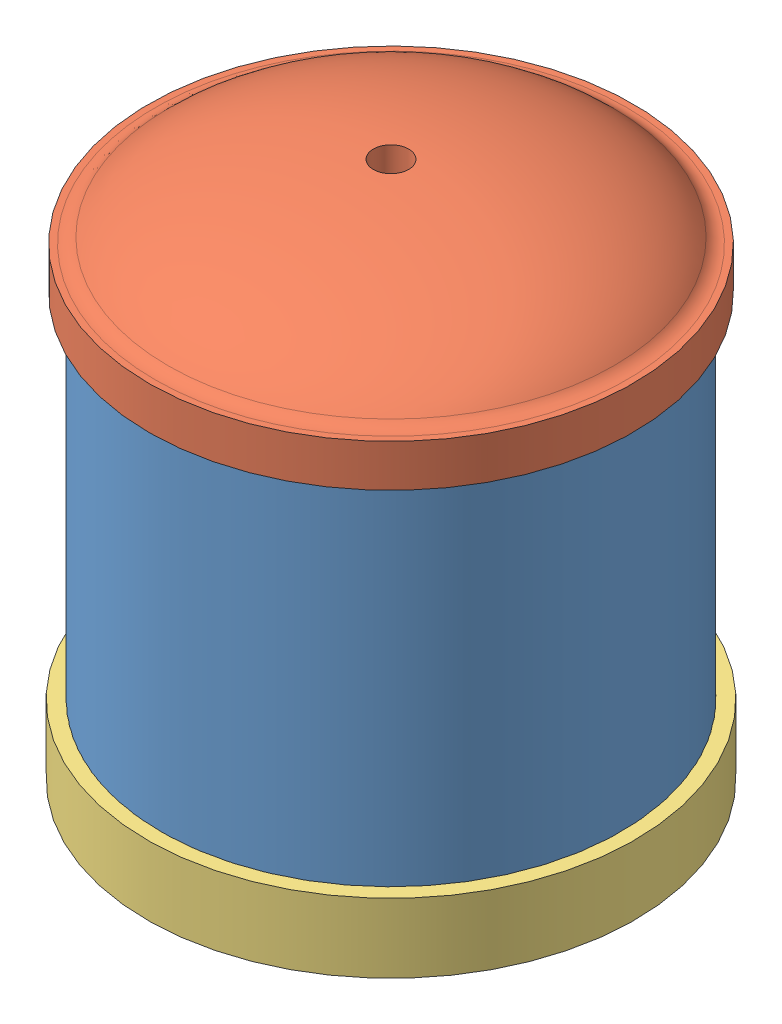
SolidWorks assembly Housing_Assy.SLDASM, configuration Default (file format 5000). Lengths in mm.
Overall size (242.58 220.29 242.58).
3 component instances, 3 part files, 4 mates.
Components (placement in the parent):
- View Port, Acrylic 150m-1: View Port, Acrylic 150m.SLDPRT [Default] at (6.3241 -7.9429 2.0583) size (165.1 151.39 165.1)
- CH End Cap - 300m PORT-no tab-rev D-1: CH End Cap - 300m PORT-no tab-rev D.SLDPRT [Added Rib] at (6.3241 61.7571 2.0583) x (0.999996 0 -0.002666) z (0.002666 0 0.999996) size (174 41.54 174)
- CH End Cap - 300m STBD-no tab-revf-1: CH End Cap - 300m STBD-no tab-revf.SLDPRT [Add Rib] at (6.3241 -77.6405 2.0583) x (-0.837169 0 -0.546944) z (-0.546944 0 0.837169) size (175.26 52.26 175.26)
Mates (geometry in assembly coordinates):
- Concentric1: concentric aligned: cylinder of View Port, Acrylic 150m-1 through (6.3241 77.9091 2.0583) axis (0 1 0) radius 82.55; cylinder of CH End Cap - 300m PORT-no tab-rev D-1 through (6.3241 148.1171 2.0583) axis (0 1 0) radius 87
- Coincident1: coincident anti-aligned: plane of View Port, Acrylic 150m-1 through (82.5241 67.7515 2.0583) normal (0 1 0); plane of CH End Cap - 300m PORT-no tab-rev D-1 through (77.8238 67.7515 1.8677) normal (0 -1 0)
- Coincident2: coincident anti-aligned: plane of CH End Cap - 300m STBD-no tab-revf-1 through (-53.5335 -83.6349 -37.0482) normal (0 1 0); plane of View Port, Acrylic 150m-1 through (88.8741 -83.6349 2.0583) normal (0 -1 0)
- Concentric2: concentric anti-aligned: cylinder of View Port, Acrylic 150m-1 through (6.3241 77.9091 2.0583) axis (0 1 0) radius 82.55; cylinder of CH End Cap - 300m STBD-no tab-revf-1 through (6.3241 -164.0005 2.0583) axis (0 -1 0) radius 87.63
